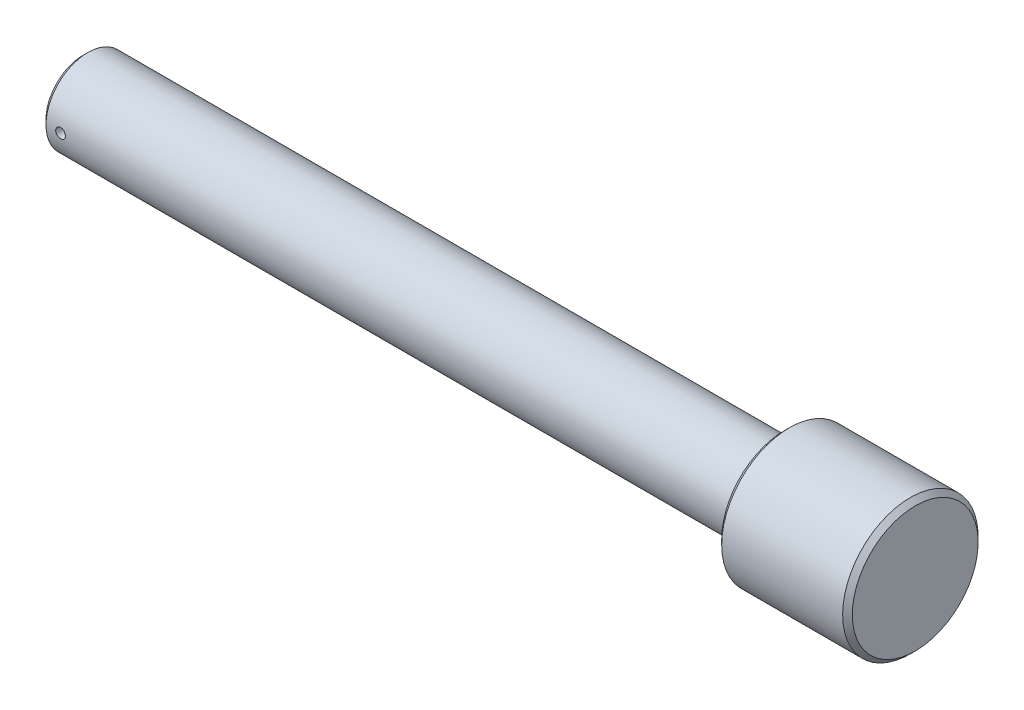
from build123d import *

# Parameters (mm, degrees)
ENL_V_MAT_EXTRU_1_DEPTH      = 174.135784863
ENL_V_MAT_EXTRU_1_DEPTH_BACK = 174.135784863
ESQUISSE2_R                  = 1


with BuildPart() as part:
    # Esquisse1 → R_volution1 (revolve)
    with BuildSketch(Plane.XY, mode=Mode.PRIVATE) as r_volution1_sk:
        Polygon((0, 0), (0, 7.65), (1, 8.65), (145, 8.65), (145, 13), (146, 14), (171, 14), (172, 13), (172, 0), align=None)
    revolve(r_volution1_sk.sketch.rotate(Axis((0, 0, 0), (1, 0, 0)), 90), axis=Axis((0, 0, 0), (1, 0, 0)))

    # Esquisse2 → Enl_v. mat.-Extru.1 (cut, two sides: drawn at the far end of the back side and taken through both)
    with BuildSketch(Plane.XY.offset(-ENL_V_MAT_EXTRU_1_DEPTH_BACK)):
        with Locations((4, 0)):
            Circle(ESQUISSE2_R)
    extrude(amount=ENL_V_MAT_EXTRU_1_DEPTH + ENL_V_MAT_EXTRU_1_DEPTH_BACK, mode=Mode.SUBTRACT)


solid = part.part
